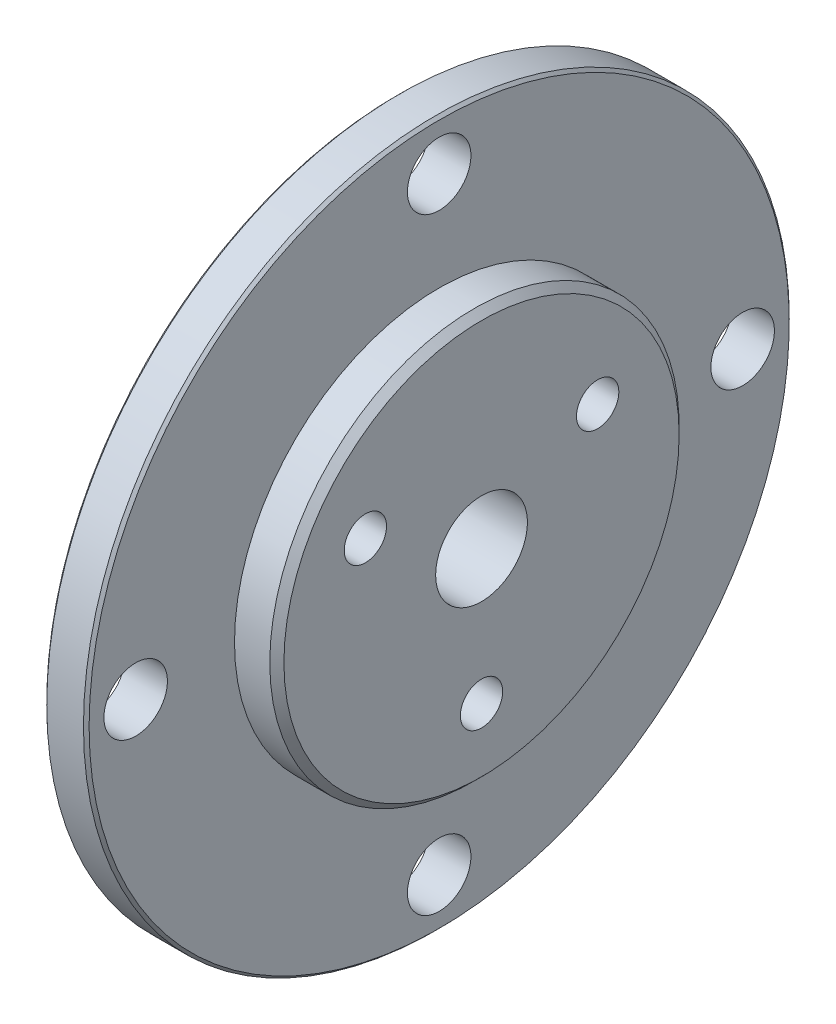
from build123d import *

# Parameters (mm, degrees)
CHANFREIN1_SIZE                    = 0.5
CHANFREIN2_SIZE                    = 0.2
ESQUISSE2_R                        = 1.5
TROU_DE_FIXATION_DU_MOTEUR_DEPTH   = 36.860842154
R_P_TITION_DES_3_TROUS_COUNT       = 3
ESQUISSE3_R                        = 2.25
TROU_DE_FIXATION_DE_LA_BRIDE_DEPTH = 36.860842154
R_P_TITION_DES_4_TROUS_COUNT       = 4


with BuildPart() as part:
    # Esquisse1 → Base-R_volution (revolve)
    with BuildSketch(Plane.XY, mode=Mode.PRIVATE) as base_r_volution_sk:
        Polygon((-3, 3.25), (-3, 25), (0, 25), (0, 14.5), (3, 14.5), (3, 3.25), align=None)
    revolve(base_r_volution_sk.sketch.rotate(Axis((-30.73022942, 0, 0), (1, 0, 0)), 90), axis=Axis((-30.73022942, 0, 0), (1, 0, 0)))

    # Chanfrein1
    chanfrein1_edges = [part.edges().sort_by_distance(p)[0] for p in [
        (3, 0, -14.5),
    ]]
    chamfer(chanfrein1_edges, length=CHANFREIN1_SIZE)

    # Chanfrein2
    chanfrein2_edges = [part.edges().sort_by_distance(p)[0] for p in [
        (0, 0, -25),
        (-3, 0, -25),
    ]]
    chamfer(chanfrein2_edges, length=CHANFREIN2_SIZE)

    # Esquisse2 → Trou de fixation du moteur (cut, through all)
    with BuildSketch(Plane(origin=(3, 0, 0), x_dir=(0, 0, -1), z_dir=(1, 0, 0))):
        with Locations((-8.227241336, 4.75)):
            Circle(ESQUISSE2_R)
    trou_de_fixation_du_moteur = extrude(amount=-TROU_DE_FIXATION_DU_MOTEUR_DEPTH, mode=Mode.SUBTRACT)

    # R_p_tition des 3 trous: Trou de fixation du moteur ×3 about axis
    r_p_tition_des_3_trous_axis = Axis((19.26977058, 0, 0), (-1, 0, 0))
    for i in range(1, R_P_TITION_DES_3_TROUS_COUNT):
        add(trou_de_fixation_du_moteur.rotate(r_p_tition_des_3_trous_axis, i * 360 / R_P_TITION_DES_3_TROUS_COUNT), mode=Mode.SUBTRACT)

    # Esquisse3 → Trou de fixation de la bride (cut, through all)
    with BuildSketch(Plane.ZY.offset(3)):
        with Locations((0, 21.5)):
            Circle(ESQUISSE3_R)
    trou_de_fixation_de_la_bride = extrude(amount=-TROU_DE_FIXATION_DE_LA_BRIDE_DEPTH, mode=Mode.SUBTRACT)

    # R_p_tition des 4 trous: Trou de fixation de la bride ×4 about axis
    r_p_tition_des_4_trous_axis = Axis((19.26977058, 0, 0), (-1, 0, 0))
    for i in range(1, R_P_TITION_DES_4_TROUS_COUNT):
        add(trou_de_fixation_de_la_bride.rotate(r_p_tition_des_4_trous_axis, i * 360 / R_P_TITION_DES_4_TROUS_COUNT), mode=Mode.SUBTRACT)


solid = part.part
